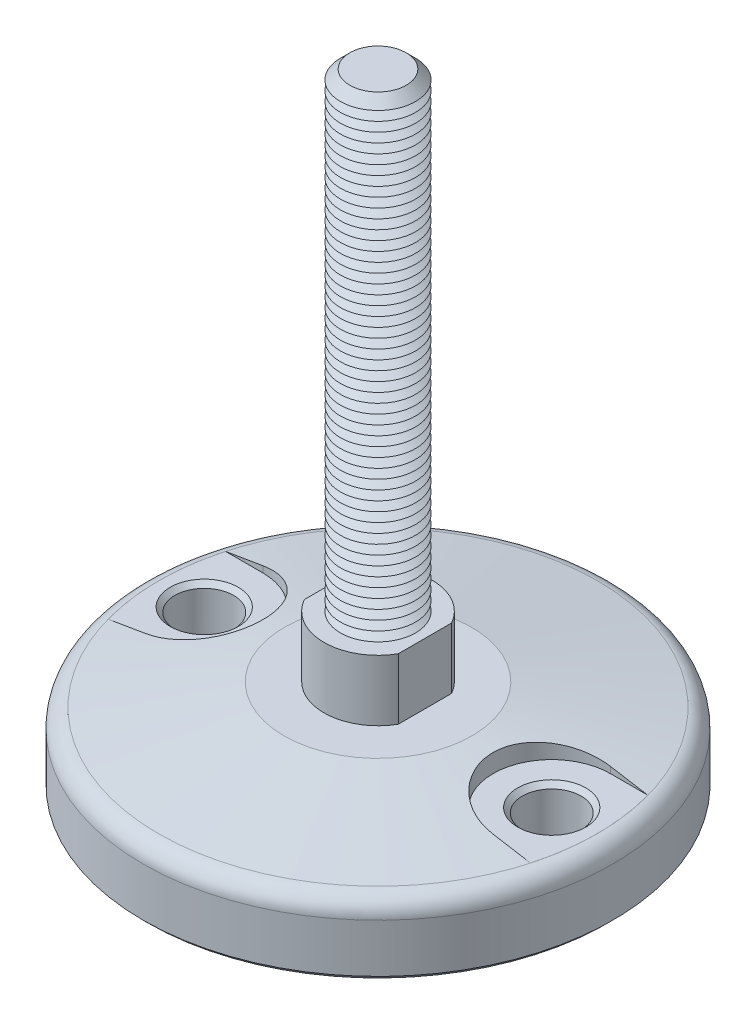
from build123d import *

# Parameters (mm, degrees)
FILLET1_R                = 4
SKETCH3_R                = 11.5
BOSS_EXTRUDE1_DEPTH      = 13
CUT_EXTRUDE1_START       = -13
CUT_EXTRUDE1_DEPTH       = 13
SKETCH5_R                = 8
BOSS_EXTRUDE2_DEPTH      = 100
CHAMFER1_SIZE            = 2
LPATTERN1_COUNT          = 49
LPATTERN1_PITCH          = 2
CUT_EXTRUDE4_DEPTH       = 4.7
SKETCH10_R               = 6.25
CUT_EXTRUDE5_DEPTH       = 15.3
CHAMFER2_SIZE            = 1
CHAMFER2_OF_MIRROR1_SIZE = 1
CHAMFER3_SIZE            = 1


with BuildPart() as part:
    # Sketch2 → Revolve1 (revolve)
    with BuildSketch(Plane(origin=(0, 0, 0), x_dir=(0, 0, -1), z_dir=(1, 0, 0))):
        Polygon((0, 0), (-20, 0), (-50, -5.289809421), (-50, -20), (0, -20), align=None)
    revolve(axis=Axis((0, 61.338865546, 0), (0, -1, 0)))

    # Fillet1
    fillet1_edges = [part.edges().sort_by_distance(p)[0] for p in [
        (0, -5.289809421, -50),
    ]]
    fillet(fillet1_edges, radius=FILLET1_R)

    # Sketch3 → Boss-Extrude1 (add)
    with BuildSketch(Plane(origin=(0, 0, 0), x_dir=(1, 0, 0), z_dir=(0, 1, 0))):
        with Locations(Location((0, 0, 0), (0, 0, 90))):
            Circle(SKETCH3_R)
    extrude(amount=BOSS_EXTRUDE1_DEPTH)

    # Sketch4 → Cut-Extrude1 (cut)
    with BuildSketch(Plane(origin=(0, 13, 0), x_dir=(1, 0, 0), z_dir=(0, 1, 0)).offset(CUT_EXTRUDE1_START)):
        with BuildLine():
            Line((-10, 5.678908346), (-10, -5.678908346))
            ThreePointArc((-10, -5.678908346), (-11.5, 0), (-10, 5.678908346))
        make_face()
        with BuildLine():
            Line((10, -5.678908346), (10, 5.678908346))
            ThreePointArc((10, 5.678908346), (11.5, 0), (10, -5.678908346))
        make_face()
    extrude(amount=CUT_EXTRUDE1_DEPTH, mode=Mode.SUBTRACT)

    # Sketch5 → Boss-Extrude2 (add)
    with BuildSketch(Plane(origin=(0, 13, 0), x_dir=(1, 0, 0), z_dir=(0, 1, 0))):
        with Locations(Location((0, 0, 0), (0, 0, 270))):
            Circle(SKETCH5_R)
    extrude(amount=BOSS_EXTRUDE2_DEPTH)

    # Chamfer1
    chamfer1_edges = [part.edges().sort_by_distance(p)[0] for p in [
        (0, 113, -8),
    ]]
    chamfer(chamfer1_edges, length=CHAMFER1_SIZE)

    # Sketch6 → Cut-Revolve1 (revolve, cut)
    with BuildSketch(Plane(origin=(0, 0, 0), x_dir=(0, 0, -1), z_dir=(1, 0, 0))):
        Polygon((-8, 13), (-6.267949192, 14), (-8, 15), align=None)
    cut_revolve1 = revolve(axis=Axis((0, 61.338865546, 0), (0, -1, 0)), mode=Mode.SUBTRACT)

    # LPattern1: Cut-Revolve1 ×49
    with Locations(*[(0, i * LPATTERN1_PITCH, 0) for i in range(1, LPATTERN1_COUNT)]):
        add(cut_revolve1, mode=Mode.SUBTRACT)

    # Sketch8 → Cut-Extrude4 (cut)
    with BuildSketch(Plane(origin=(0, 0, 0), x_dir=(1, 0, 0), z_dir=(0, 1, 0))):
        with BuildLine():
            Line((-37, 12.5), (-44.990387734, 12.5))
            ThreePointArc((-44.990387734, 12.5), (-46.694592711, 0), (-44.990387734, -12.5))
            Line((-44.990387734, -12.5), (-37, -12.5))
            ThreePointArc((-37, -12.5), (-24.5, 0), (-37, 12.5))
        make_face()
    cut_extrude4 = extrude(amount=-CUT_EXTRUDE4_DEPTH, mode=Mode.SUBTRACT)

    # Sketch10 → Cut-Extrude5 (cut)
    with BuildSketch(Plane(origin=(0, -4.7, 0), x_dir=(1, 0, 0), z_dir=(0, 1, 0))):
        with Locations(Location((-37, 0, 0), (0, 0, 270))):
            Circle(SKETCH10_R)
    cut_extrude5 = extrude(amount=-CUT_EXTRUDE5_DEPTH, mode=Mode.SUBTRACT)

    # Chamfer2
    chamfer2_edges = [part.edges().sort_by_distance(p)[0] for p in [
        (-37, -4.7, -6.25),
        (-37, -20, -6.25),
    ]]
    chamfer(chamfer2_edges, length=CHAMFER2_SIZE)

    # Mirror1: Cut-Extrude4, Cut-Extrude5 across plane
    add(cut_extrude4.mirror(Plane(origin=(0, 0, 0), x_dir=(0, 0, 1), z_dir=(1, 0, 0))), mode=Mode.SUBTRACT)
    add(cut_extrude5.mirror(Plane(origin=(0, 0, 0), x_dir=(0, 0, 1), z_dir=(1, 0, 0))), mode=Mode.SUBTRACT)

    # Chamfer2 of Mirror1
    chamfer2_of_mirror1_edges = [part.edges().sort_by_distance(p)[0] for p in [
        (37, -4.7, -6.25),
        (37, -20, -6.25),
    ]]
    chamfer(chamfer2_of_mirror1_edges, length=CHAMFER2_OF_MIRROR1_SIZE)

    # Chamfer3
    chamfer3_edges = [part.edges().sort_by_distance(p)[0] for p in [
        (0, -20, -50),
    ]]
    chamfer(chamfer3_edges, length=CHAMFER3_SIZE)


solid = part.part
